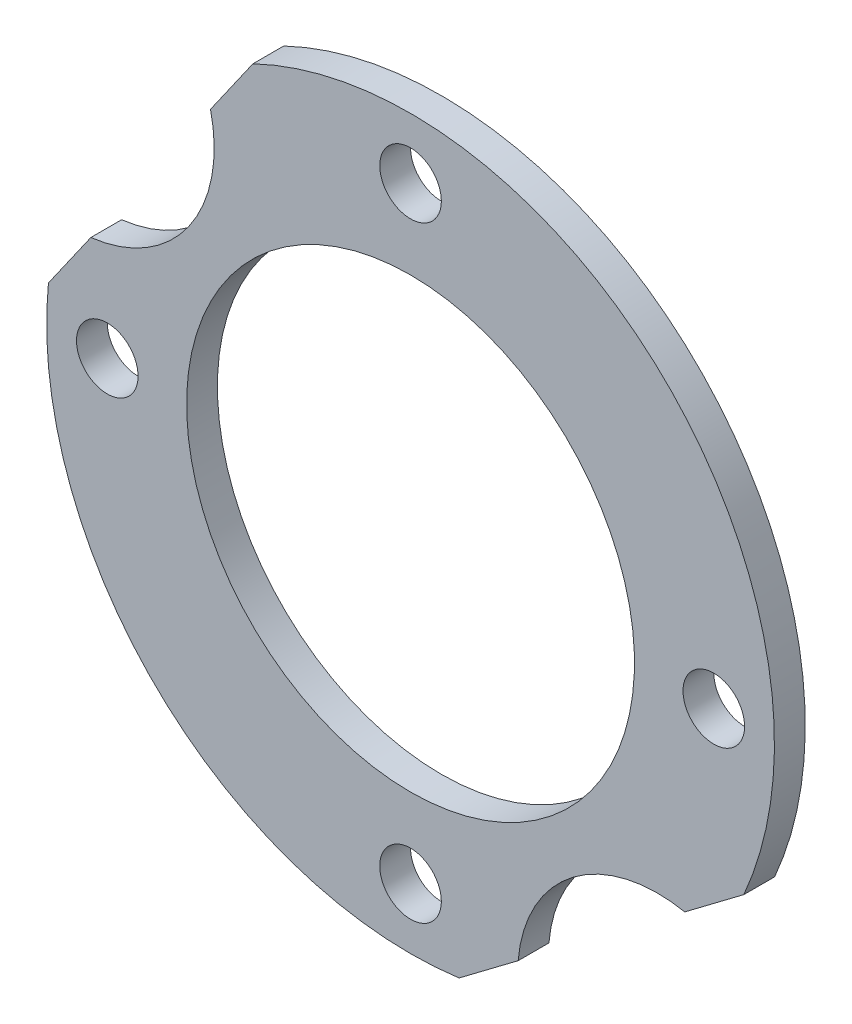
ISO-10303-21;
HEADER;
FILE_DESCRIPTION(('STEP AP214'),'2;1');
FILE_NAME('part.step','',(''),(''),'','','');
FILE_SCHEMA(('AUTOMOTIVE_DESIGN { 1 0 10303 214 1 1 1 1 }'));
ENDSEC;
DATA;
#1=APPLICATION_CONTEXT('core data for automotive mechanical design processes');
#2=APPLICATION_PROTOCOL_DEFINITION('international standard','automotive_design',2000,#1);
#3=PRODUCT_CONTEXT('',#1,'mechanical');
#4=PRODUCT('Part','Part','',(#3));
#5=PRODUCT_RELATED_PRODUCT_CATEGORY('part','',(#4));
#6=PRODUCT_DEFINITION_FORMATION('','',#4);
#7=PRODUCT_DEFINITION_CONTEXT('part definition',#1,'design');
#8=PRODUCT_DEFINITION('design','',#6,#7);
#9=PRODUCT_DEFINITION_SHAPE('','',#8);
#10=(LENGTH_UNIT() NAMED_UNIT(*) SI_UNIT(.MILLI.,.METRE.));
#11=(NAMED_UNIT(*) PLANE_ANGLE_UNIT() SI_UNIT($,.RADIAN.));
#12=(NAMED_UNIT(*) SI_UNIT($,.STERADIAN.) SOLID_ANGLE_UNIT());
#13=UNCERTAINTY_MEASURE_WITH_UNIT(LENGTH_MEASURE(1.E-05),#10,'distance_accuracy_value','');
#14=(GEOMETRIC_REPRESENTATION_CONTEXT(3) GLOBAL_UNCERTAINTY_ASSIGNED_CONTEXT((#13)) GLOBAL_UNIT_ASSIGNED_CONTEXT((#10,
#11,#12)) REPRESENTATION_CONTEXT('',''));
#15=CARTESIAN_POINT('',(0.,0.,0.));
#16=DIRECTION('',(0.,0.,1.));
#17=DIRECTION('',(1.,0.,0.));
#18=AXIS2_PLACEMENT_3D('',#15,#16,#17);
#19=CARTESIAN_POINT('',(344.982648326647,748.800407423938,41.5464573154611));
#20=DIRECTION('',(0.,0.,-1.));
#21=DIRECTION('',(0.,1.,0.));
#22=AXIS2_PLACEMENT_3D('',#19,#20,#21);
#23=PLANE('',#22);
#24=DIRECTION('',(-0.573532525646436,-0.819182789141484,0.));
#25=VECTOR('',#24,1.);
#26=CARTESIAN_POINT('',(331.07798205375,787.046702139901,41.5464573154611));
#27=LINE('',#26,#25);
#28=CARTESIAN_POINT('',(326.532691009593,780.554613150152,41.5464573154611));
#29=VERTEX_POINT('',#28);
#30=CARTESIAN_POINT('',(331.07798205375,787.046702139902,41.5464573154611));
#31=VERTEX_POINT('',#30);
#32=EDGE_CURVE('E78',#29,#31,#27,.F.);
#33=ORIENTED_EDGE('',*,*,#32,.F.);
#34=CARTESIAN_POINT('',(311.928409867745,777.131898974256,41.5464573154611));
#35=DIRECTION('',(0.,0.,-1.));
#36=DIRECTION('',(-1.,0.,0.));
#37=AXIS2_PLACEMENT_3D('',#34,#35,#36);
#38=CIRCLE('',#37,15.);
#39=CARTESIAN_POINT('',(313.7070689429,762.237726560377,41.5464573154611));
#40=VERTEX_POINT('',#39);
#41=EDGE_CURVE('E146',#40,#29,#38,.F.);
#42=ORIENTED_EDGE('',*,*,#41,.F.);
#43=DIRECTION('',(-0.573620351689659,-0.819121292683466,0.));
#44=VECTOR('',#43,1.);
#45=CARTESIAN_POINT('',(313.7070689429,762.237726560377,41.5464573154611));
#46=LINE('',#45,#44);
#47=CARTESIAN_POINT('',(309.161732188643,755.747053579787,41.5464573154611));
#48=VERTEX_POINT('',#47);
#49=EDGE_CURVE('E113',#48,#40,#46,.F.);
#50=ORIENTED_EDGE('',*,*,#49,.F.);
#51=CARTESIAN_POINT('',(347.971056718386,751.895257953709,41.5464573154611));
#52=DIRECTION('',(0.,0.,-1.));
#53=DIRECTION('',(0.,1.,0.));
#54=AXIS2_PLACEMENT_3D('',#51,#52,#53);
#55=CIRCLE('',#54,39.);
#56=CARTESIAN_POINT('',(353.174931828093,713.244000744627,41.5464573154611));
#57=VERTEX_POINT('',#56);
#58=EDGE_CURVE('E149',#57,#48,#55,.T.);
#59=ORIENTED_EDGE('',*,*,#58,.F.);
#60=DIRECTION('',(0.798656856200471,0.601786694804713,0.));
#61=VECTOR('',#60,1.);
#62=CARTESIAN_POINT('',(353.174931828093,713.244000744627,41.5464573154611));
#63=LINE('',#62,#61);
#64=CARTESIAN_POINT('',(359.50361786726,718.012655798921,41.5464573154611));
#65=VERTEX_POINT('',#64);
#66=EDGE_CURVE('E116',#65,#57,#63,.F.);
#67=ORIENTED_EDGE('',*,*,#66,.F.);
#68=CARTESIAN_POINT('',(374.45079146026,716.754879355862,41.5464573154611));
#69=DIRECTION('',(0.,0.,-1.));
#70=DIRECTION('',(-1.,0.,0.));
#71=AXIS2_PLACEMENT_3D('',#68,#69,#70);
#72=CIRCLE('',#71,15.);
#73=CARTESIAN_POINT('',(377.361738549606,731.469714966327,41.5464573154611));
#74=VERTEX_POINT('',#73);
#75=EDGE_CURVE('E97',#74,#65,#72,.F.);
#76=ORIENTED_EDGE('',*,*,#75,.F.);
#77=DIRECTION('',(0.798614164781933,0.601843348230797,0.));
#78=VECTOR('',#77,1.);
#79=CARTESIAN_POINT('',(377.361738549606,731.469714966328,41.5464573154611));
#80=LINE('',#79,#78);
#81=CARTESIAN_POINT('',(383.690647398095,736.239241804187,41.5464573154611));
#82=VERTEX_POINT('',#81);
#83=EDGE_CURVE('E94',#82,#74,#80,.F.);
#84=ORIENTED_EDGE('',*,*,#83,.F.);
#85=CARTESIAN_POINT('',(347.971056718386,751.895257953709,41.5464573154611));
#86=DIRECTION('',(0.,0.,-1.));
#87=DIRECTION('',(0.,1.,0.));
#88=AXIS2_PLACEMENT_3D('',#85,#86,#87);
#89=CIRCLE('',#88,39.);
#90=EDGE_CURVE('E83',#31,#82,#89,.T.);
#91=ORIENTED_EDGE('',*,*,#90,.F.);
#92=EDGE_LOOP('',(#33,#42,#50,#59,#67,#76,#84,#91));
#93=FACE_BOUND('',#92,.T.);
#94=CARTESIAN_POINT('',(380.471098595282,751.895257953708,41.5464573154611));
#95=DIRECTION('',(0.,0.,-1.));
#96=DIRECTION('',(0.,1.,0.));
#97=AXIS2_PLACEMENT_3D('',#94,#95,#96);
#98=CIRCLE('',#97,3.3);
#99=CARTESIAN_POINT('',(380.471098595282,755.195257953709,41.5464573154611));
#100=VERTEX_POINT('',#99);
#101=EDGE_CURVE('E112',#100,#100,#98,.T.);
#102=ORIENTED_EDGE('',*,*,#101,.T.);
#103=EDGE_LOOP('',(#102));
#104=FACE_BOUND('',#103,.T.);
#105=CARTESIAN_POINT('',(347.971056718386,784.395299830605,41.5464573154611));
#106=DIRECTION('',(0.,0.,-1.));
#107=DIRECTION('',(0.,1.,0.));
#108=AXIS2_PLACEMENT_3D('',#105,#106,#107);
#109=CIRCLE('',#108,3.3);
#110=CARTESIAN_POINT('',(347.971056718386,787.695299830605,41.5464573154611));
#111=VERTEX_POINT('',#110);
#112=EDGE_CURVE('E154',#111,#111,#109,.T.);
#113=ORIENTED_EDGE('',*,*,#112,.T.);
#114=EDGE_LOOP('',(#113));
#115=FACE_BOUND('',#114,.T.);
#116=CARTESIAN_POINT('',(315.47101484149,751.895257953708,41.5464573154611));
#117=DIRECTION('',(0.,0.,-1.));
#118=DIRECTION('',(0.,1.,0.));
#119=AXIS2_PLACEMENT_3D('',#116,#117,#118);
#120=CIRCLE('',#119,3.3);
#121=CARTESIAN_POINT('',(315.47101484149,755.195257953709,41.5464573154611));
#122=VERTEX_POINT('',#121);
#123=EDGE_CURVE('E157',#122,#122,#120,.T.);
#124=ORIENTED_EDGE('',*,*,#123,.T.);
#125=EDGE_LOOP('',(#124));
#126=FACE_BOUND('',#125,.T.);
#127=CARTESIAN_POINT('',(347.971056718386,751.895257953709,41.5464573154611));
#128=DIRECTION('',(0.,0.,-1.));
#129=DIRECTION('',(0.,1.,0.));
#130=AXIS2_PLACEMENT_3D('',#127,#128,#129);
#131=CIRCLE('',#130,24.);
#132=CARTESIAN_POINT('',(347.971056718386,775.895257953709,41.5464573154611));
#133=VERTEX_POINT('',#132);
#134=EDGE_CURVE('E159',#133,#133,#131,.T.);
#135=ORIENTED_EDGE('',*,*,#134,.T.);
#136=EDGE_LOOP('',(#135));
#137=FACE_BOUND('',#136,.T.);
#138=CARTESIAN_POINT('',(347.971056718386,719.395216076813,41.5464573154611));
#139=DIRECTION('',(0.,0.,-1.));
#140=DIRECTION('',(0.,1.,0.));
#141=AXIS2_PLACEMENT_3D('',#138,#139,#140);
#142=CIRCLE('',#141,3.3);
#143=CARTESIAN_POINT('',(347.971056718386,722.695216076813,41.5464573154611));
#144=VERTEX_POINT('',#143);
#145=EDGE_CURVE('E20',#144,#144,#142,.T.);
#146=ORIENTED_EDGE('',*,*,#145,.T.);
#147=EDGE_LOOP('',(#146));
#148=FACE_BOUND('',#147,.T.);
#149=ADVANCED_FACE('F16',(#93,#104,#115,#126,#137,#148),#23,.F.);
#150=CARTESIAN_POINT('',(347.971056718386,719.395216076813,41.5464573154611));
#151=DIRECTION('',(0.,0.,-1.));
#152=DIRECTION('',(0.,1.,0.));
#153=AXIS2_PLACEMENT_3D('',#150,#151,#152);
#154=CYLINDRICAL_SURFACE('',#153,3.3);
#155=CARTESIAN_POINT('',(347.971056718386,719.395216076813,38.2464573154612));
#156=DIRECTION('',(0.,0.,-1.));
#157=DIRECTION('',(0.,1.,0.));
#158=AXIS2_PLACEMENT_3D('',#155,#156,#157);
#159=CIRCLE('',#158,3.3);
#160=CARTESIAN_POINT('',(347.971056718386,722.695216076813,38.2464573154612));
#161=VERTEX_POINT('',#160);
#162=EDGE_CURVE('E142',#161,#161,#159,.F.);
#163=ORIENTED_EDGE('',*,*,#162,.F.);
#164=EDGE_LOOP('',(#163));
#165=FACE_BOUND('',#164,.T.);
#166=ORIENTED_EDGE('',*,*,#145,.F.);
#167=EDGE_LOOP('',(#166));
#168=FACE_BOUND('',#167,.T.);
#169=ADVANCED_FACE('F172',(#165,#168),#154,.F.);
#170=CARTESIAN_POINT('',(347.971056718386,751.895257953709,41.5464573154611));
#171=DIRECTION('',(0.,0.,-1.));
#172=DIRECTION('',(0.,1.,0.));
#173=AXIS2_PLACEMENT_3D('',#170,#171,#172);
#174=CYLINDRICAL_SURFACE('',#173,24.);
#175=CARTESIAN_POINT('',(347.971056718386,751.895257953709,38.2464573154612));
#176=DIRECTION('',(0.,0.,-1.));
#177=DIRECTION('',(0.,1.,0.));
#178=AXIS2_PLACEMENT_3D('',#175,#176,#177);
#179=CIRCLE('',#178,24.);
#180=CARTESIAN_POINT('',(347.971056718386,775.895257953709,38.2464573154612));
#181=VERTEX_POINT('',#180);
#182=EDGE_CURVE('E139',#181,#181,#179,.F.);
#183=ORIENTED_EDGE('',*,*,#182,.F.);
#184=EDGE_LOOP('',(#183));
#185=FACE_BOUND('',#184,.T.);
#186=ORIENTED_EDGE('',*,*,#134,.F.);
#187=EDGE_LOOP('',(#186));
#188=FACE_BOUND('',#187,.T.);
#189=ADVANCED_FACE('F174',(#185,#188),#174,.F.);
#190=CARTESIAN_POINT('',(315.47101484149,751.895257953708,41.5464573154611));
#191=DIRECTION('',(0.,0.,-1.));
#192=DIRECTION('',(0.,1.,0.));
#193=AXIS2_PLACEMENT_3D('',#190,#191,#192);
#194=CYLINDRICAL_SURFACE('',#193,3.3);
#195=CARTESIAN_POINT('',(315.47101484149,751.895257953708,38.2464573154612));
#196=DIRECTION('',(0.,0.,-1.));
#197=DIRECTION('',(0.,1.,0.));
#198=AXIS2_PLACEMENT_3D('',#195,#196,#197);
#199=CIRCLE('',#198,3.3);
#200=CARTESIAN_POINT('',(315.47101484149,755.195257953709,38.2464573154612));
#201=VERTEX_POINT('',#200);
#202=EDGE_CURVE('E136',#201,#201,#199,.F.);
#203=ORIENTED_EDGE('',*,*,#202,.F.);
#204=EDGE_LOOP('',(#203));
#205=FACE_BOUND('',#204,.T.);
#206=ORIENTED_EDGE('',*,*,#123,.F.);
#207=EDGE_LOOP('',(#206));
#208=FACE_BOUND('',#207,.T.);
#209=ADVANCED_FACE('F181',(#205,#208),#194,.F.);
#210=CARTESIAN_POINT('',(347.971056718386,784.395299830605,41.5464573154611));
#211=DIRECTION('',(0.,0.,-1.));
#212=DIRECTION('',(0.,1.,0.));
#213=AXIS2_PLACEMENT_3D('',#210,#211,#212);
#214=CYLINDRICAL_SURFACE('',#213,3.3);
#215=CARTESIAN_POINT('',(347.971056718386,784.395299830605,38.2464573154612));
#216=DIRECTION('',(0.,0.,-1.));
#217=DIRECTION('',(0.,1.,0.));
#218=AXIS2_PLACEMENT_3D('',#215,#216,#217);
#219=CIRCLE('',#218,3.3);
#220=CARTESIAN_POINT('',(347.971056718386,787.695299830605,38.2464573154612));
#221=VERTEX_POINT('',#220);
#222=EDGE_CURVE('E133',#221,#221,#219,.F.);
#223=ORIENTED_EDGE('',*,*,#222,.F.);
#224=EDGE_LOOP('',(#223));
#225=FACE_BOUND('',#224,.T.);
#226=ORIENTED_EDGE('',*,*,#112,.F.);
#227=EDGE_LOOP('',(#226));
#228=FACE_BOUND('',#227,.T.);
#229=ADVANCED_FACE('F208',(#225,#228),#214,.F.);
#230=CARTESIAN_POINT('',(380.471098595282,751.895257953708,41.5464573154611));
#231=DIRECTION('',(0.,0.,-1.));
#232=DIRECTION('',(0.,1.,0.));
#233=AXIS2_PLACEMENT_3D('',#230,#231,#232);
#234=CYLINDRICAL_SURFACE('',#233,3.3);
#235=CARTESIAN_POINT('',(380.471098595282,751.895257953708,38.2464573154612));
#236=DIRECTION('',(0.,0.,-1.));
#237=DIRECTION('',(0.,1.,0.));
#238=AXIS2_PLACEMENT_3D('',#235,#236,#237);
#239=CIRCLE('',#238,3.3);
#240=CARTESIAN_POINT('',(380.471098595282,755.195257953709,38.2464573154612));
#241=VERTEX_POINT('',#240);
#242=EDGE_CURVE('E130',#241,#241,#239,.F.);
#243=ORIENTED_EDGE('',*,*,#242,.F.);
#244=EDGE_LOOP('',(#243));
#245=FACE_BOUND('',#244,.T.);
#246=ORIENTED_EDGE('',*,*,#101,.F.);
#247=EDGE_LOOP('',(#246));
#248=FACE_BOUND('',#247,.T.);
#249=ADVANCED_FACE('F215',(#245,#248),#234,.F.);
#250=CARTESIAN_POINT('',(331.07798205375,787.046702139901,41.5464573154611));
#251=DIRECTION('',(-0.819182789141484,0.573532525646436,0.));
#252=DIRECTION('',(-0.573532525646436,-0.819182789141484,0.));
#253=AXIS2_PLACEMENT_3D('',#250,#251,#252);
#254=PLANE('',#253);
#255=ORIENTED_EDGE('',*,*,#32,.T.);
#256=DIRECTION('',(0.,0.,-1.));
#257=VECTOR('',#256,1.);
#258=CARTESIAN_POINT('',(331.07798205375,787.046702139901,41.5464573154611));
#259=LINE('',#258,#257);
#260=CARTESIAN_POINT('',(331.07798205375,787.046702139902,38.2464573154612));
#261=VERTEX_POINT('',#260);
#262=EDGE_CURVE('E90',#261,#31,#259,.F.);
#263=ORIENTED_EDGE('',*,*,#262,.F.);
#264=DIRECTION('',(0.573532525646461,0.819182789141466,0.));
#265=VECTOR('',#264,1.);
#266=CARTESIAN_POINT('',(326.532691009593,780.554613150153,38.2464573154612));
#267=LINE('',#266,#265);
#268=CARTESIAN_POINT('',(326.532691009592,780.554613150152,38.2464573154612));
#269=VERTEX_POINT('',#268);
#270=EDGE_CURVE('E129',#269,#261,#267,.T.);
#271=ORIENTED_EDGE('',*,*,#270,.F.);
#272=DIRECTION('',(0.,0.,-1.));
#273=VECTOR('',#272,1.);
#274=CARTESIAN_POINT('',(326.532691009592,780.554613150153,41.5464573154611));
#275=LINE('',#274,#273);
#276=EDGE_CURVE('E145',#29,#269,#275,.T.);
#277=ORIENTED_EDGE('',*,*,#276,.F.);
#278=EDGE_LOOP('',(#255,#263,#271,#277));
#279=FACE_BOUND('',#278,.T.);
#280=ADVANCED_FACE('F220',(#279),#254,.T.);
#281=CARTESIAN_POINT('',(347.971056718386,751.895257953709,41.5464573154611));
#282=DIRECTION('',(0.,0.,-1.));
#283=DIRECTION('',(0.,1.,0.));
#284=AXIS2_PLACEMENT_3D('',#281,#282,#283);
#285=CYLINDRICAL_SURFACE('',#284,39.);
#286=ORIENTED_EDGE('',*,*,#90,.T.);
#287=DIRECTION('',(0.,0.,1.));
#288=VECTOR('',#287,1.);
#289=CARTESIAN_POINT('',(383.690647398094,736.239241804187,41.5464573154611));
#290=LINE('',#289,#288);
#291=CARTESIAN_POINT('',(383.690647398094,736.239241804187,38.2464573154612));
#292=VERTEX_POINT('',#291);
#293=EDGE_CURVE('E88',#292,#82,#290,.T.);
#294=ORIENTED_EDGE('',*,*,#293,.F.);
#295=CARTESIAN_POINT('',(347.971056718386,751.895257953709,38.2464573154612));
#296=DIRECTION('',(0.,0.,-1.));
#297=DIRECTION('',(0.,1.,0.));
#298=AXIS2_PLACEMENT_3D('',#295,#296,#297);
#299=CIRCLE('',#298,39.);
#300=EDGE_CURVE('E127',#261,#292,#299,.T.);
#301=ORIENTED_EDGE('',*,*,#300,.F.);
#302=ORIENTED_EDGE('',*,*,#262,.T.);
#303=EDGE_LOOP('',(#286,#294,#301,#302));
#304=FACE_BOUND('',#303,.T.);
#305=ADVANCED_FACE('F85',(#304),#285,.T.);
#306=CARTESIAN_POINT('',(377.361738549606,731.469714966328,41.5464573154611));
#307=DIRECTION('',(0.601843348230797,-0.798614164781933,0.));
#308=DIRECTION('',(0.798614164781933,0.601843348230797,0.));
#309=AXIS2_PLACEMENT_3D('',#306,#307,#308);
#310=PLANE('',#309);
#311=ORIENTED_EDGE('',*,*,#83,.T.);
#312=DIRECTION('',(0.,0.,-1.));
#313=VECTOR('',#312,1.);
#314=CARTESIAN_POINT('',(377.361738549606,731.469714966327,41.5464573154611));
#315=LINE('',#314,#313);
#316=CARTESIAN_POINT('',(377.361738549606,731.469714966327,38.2464573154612));
#317=VERTEX_POINT('',#316);
#318=EDGE_CURVE('E100',#317,#74,#315,.F.);
#319=ORIENTED_EDGE('',*,*,#318,.F.);
#320=DIRECTION('',(-0.798614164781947,-0.601843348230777,0.));
#321=VECTOR('',#320,1.);
#322=CARTESIAN_POINT('',(383.690647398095,736.239241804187,38.2464573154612));
#323=LINE('',#322,#321);
#324=EDGE_CURVE('E104',#292,#317,#323,.T.);
#325=ORIENTED_EDGE('',*,*,#324,.F.);
#326=ORIENTED_EDGE('',*,*,#293,.T.);
#327=EDGE_LOOP('',(#311,#319,#325,#326));
#328=FACE_BOUND('',#327,.T.);
#329=ADVANCED_FACE('F102',(#328),#310,.T.);
#330=CARTESIAN_POINT('',(374.45079146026,716.754879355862,41.5464573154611));
#331=DIRECTION('',(0.,0.,-1.));
#332=DIRECTION('',(-1.,0.,0.));
#333=AXIS2_PLACEMENT_3D('',#330,#331,#332);
#334=CYLINDRICAL_SURFACE('',#333,15.);
#335=ORIENTED_EDGE('',*,*,#75,.T.);
#336=DIRECTION('',(0.,0.,1.));
#337=VECTOR('',#336,1.);
#338=CARTESIAN_POINT('',(359.50361786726,718.012655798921,41.5464573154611));
#339=LINE('',#338,#337);
#340=CARTESIAN_POINT('',(359.50361786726,718.012655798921,38.2464573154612));
#341=VERTEX_POINT('',#340);
#342=EDGE_CURVE('E118',#341,#65,#339,.T.);
#343=ORIENTED_EDGE('',*,*,#342,.F.);
#344=CARTESIAN_POINT('',(374.45079146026,716.754879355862,38.2464573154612));
#345=DIRECTION('',(0.,0.,-1.));
#346=DIRECTION('',(-1.,0.,0.));
#347=AXIS2_PLACEMENT_3D('',#344,#345,#346);
#348=CIRCLE('',#347,15.);
#349=EDGE_CURVE('E124',#317,#341,#348,.F.);
#350=ORIENTED_EDGE('',*,*,#349,.F.);
#351=ORIENTED_EDGE('',*,*,#318,.T.);
#352=EDGE_LOOP('',(#335,#343,#350,#351));
#353=FACE_BOUND('',#352,.T.);
#354=ADVANCED_FACE('F228',(#353),#334,.F.);
#355=CARTESIAN_POINT('',(353.174931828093,713.244000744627,41.5464573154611));
#356=DIRECTION('',(0.601786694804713,-0.798656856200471,0.));
#357=DIRECTION('',(0.798656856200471,0.601786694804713,0.));
#358=AXIS2_PLACEMENT_3D('',#355,#356,#357);
#359=PLANE('',#358);
#360=ORIENTED_EDGE('',*,*,#66,.T.);
#361=DIRECTION('',(0.,0.,-1.));
#362=VECTOR('',#361,1.);
#363=CARTESIAN_POINT('',(353.174931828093,713.244000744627,41.5464573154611));
#364=LINE('',#363,#362);
#365=CARTESIAN_POINT('',(353.174931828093,713.244000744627,38.2464573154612));
#366=VERTEX_POINT('',#365);
#367=EDGE_CURVE('E117',#366,#57,#364,.F.);
#368=ORIENTED_EDGE('',*,*,#367,.F.);
#369=DIRECTION('',(-0.798656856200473,-0.60178669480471,0.));
#370=VECTOR('',#369,1.);
#371=CARTESIAN_POINT('',(359.50361786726,718.012655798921,38.2464573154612));
#372=LINE('',#371,#370);
#373=EDGE_CURVE('E123',#341,#366,#372,.T.);
#374=ORIENTED_EDGE('',*,*,#373,.F.);
#375=ORIENTED_EDGE('',*,*,#342,.T.);
#376=EDGE_LOOP('',(#360,#368,#374,#375));
#377=FACE_BOUND('',#376,.T.);
#378=ADVANCED_FACE('F231',(#377),#359,.T.);
#379=CARTESIAN_POINT('',(347.971056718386,751.895257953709,41.5464573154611));
#380=DIRECTION('',(0.,0.,-1.));
#381=DIRECTION('',(0.,1.,0.));
#382=AXIS2_PLACEMENT_3D('',#379,#380,#381);
#383=CYLINDRICAL_SURFACE('',#382,39.);
#384=ORIENTED_EDGE('',*,*,#58,.T.);
#385=DIRECTION('',(0.,0.,1.));
#386=VECTOR('',#385,1.);
#387=CARTESIAN_POINT('',(309.161732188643,755.747053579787,41.5464573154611));
#388=LINE('',#387,#386);
#389=CARTESIAN_POINT('',(309.161732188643,755.747053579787,38.2464573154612));
#390=VERTEX_POINT('',#389);
#391=EDGE_CURVE('E115',#390,#48,#388,.T.);
#392=ORIENTED_EDGE('',*,*,#391,.F.);
#393=CARTESIAN_POINT('',(347.971056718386,751.895257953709,38.2464573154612));
#394=DIRECTION('',(0.,0.,-1.));
#395=DIRECTION('',(0.,1.,0.));
#396=AXIS2_PLACEMENT_3D('',#393,#394,#395);
#397=CIRCLE('',#396,39.);
#398=EDGE_CURVE('E120',#366,#390,#397,.T.);
#399=ORIENTED_EDGE('',*,*,#398,.F.);
#400=ORIENTED_EDGE('',*,*,#367,.T.);
#401=EDGE_LOOP('',(#384,#392,#399,#400));
#402=FACE_BOUND('',#401,.T.);
#403=ADVANCED_FACE('F235',(#402),#383,.T.);
#404=CARTESIAN_POINT('',(313.7070689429,762.237726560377,41.5464573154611));
#405=DIRECTION('',(-0.819121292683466,0.573620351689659,0.));
#406=DIRECTION('',(-0.573620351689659,-0.819121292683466,0.));
#407=AXIS2_PLACEMENT_3D('',#404,#405,#406);
#408=PLANE('',#407);
#409=ORIENTED_EDGE('',*,*,#49,.T.);
#410=DIRECTION('',(0.,0.,-1.));
#411=VECTOR('',#410,1.);
#412=CARTESIAN_POINT('',(313.7070689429,762.237726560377,41.5464573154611));
#413=LINE('',#412,#411);
#414=CARTESIAN_POINT('',(313.7070689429,762.237726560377,38.2464573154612));
#415=VERTEX_POINT('',#414);
#416=EDGE_CURVE('E35',#415,#40,#413,.F.);
#417=ORIENTED_EDGE('',*,*,#416,.F.);
#418=DIRECTION('',(0.573620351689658,0.819121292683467,0.));
#419=VECTOR('',#418,1.);
#420=CARTESIAN_POINT('',(309.161732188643,755.747053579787,38.2464573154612));
#421=LINE('',#420,#419);
#422=EDGE_CURVE('E26',#390,#415,#421,.T.);
#423=ORIENTED_EDGE('',*,*,#422,.F.);
#424=ORIENTED_EDGE('',*,*,#391,.T.);
#425=EDGE_LOOP('',(#409,#417,#423,#424));
#426=FACE_BOUND('',#425,.T.);
#427=ADVANCED_FACE('F193',(#426),#408,.T.);
#428=CARTESIAN_POINT('',(311.928409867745,777.131898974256,41.5464573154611));
#429=DIRECTION('',(0.,0.,-1.));
#430=DIRECTION('',(-1.,0.,0.));
#431=AXIS2_PLACEMENT_3D('',#428,#429,#430);
#432=CYLINDRICAL_SURFACE('',#431,15.);
#433=ORIENTED_EDGE('',*,*,#41,.T.);
#434=ORIENTED_EDGE('',*,*,#276,.T.);
#435=CARTESIAN_POINT('',(311.928409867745,777.131898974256,38.2464573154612));
#436=DIRECTION('',(0.,0.,-1.));
#437=DIRECTION('',(-1.,0.,0.));
#438=AXIS2_PLACEMENT_3D('',#435,#436,#437);
#439=CIRCLE('',#438,15.);
#440=EDGE_CURVE('E11',#415,#269,#439,.F.);
#441=ORIENTED_EDGE('',*,*,#440,.F.);
#442=ORIENTED_EDGE('',*,*,#416,.T.);
#443=EDGE_LOOP('',(#433,#434,#441,#442));
#444=FACE_BOUND('',#443,.T.);
#445=ADVANCED_FACE('F188',(#444),#432,.F.);
#446=CARTESIAN_POINT('',(331.07798205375,787.046702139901,38.2464573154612));
#447=DIRECTION('',(0.,0.,-1.));
#448=DIRECTION('',(0.,1.,0.));
#449=AXIS2_PLACEMENT_3D('',#446,#447,#448);
#450=PLANE('',#449);
#451=ORIENTED_EDGE('',*,*,#422,.T.);
#452=ORIENTED_EDGE('',*,*,#440,.T.);
#453=ORIENTED_EDGE('',*,*,#270,.T.);
#454=ORIENTED_EDGE('',*,*,#300,.T.);
#455=ORIENTED_EDGE('',*,*,#324,.T.);
#456=ORIENTED_EDGE('',*,*,#349,.T.);
#457=ORIENTED_EDGE('',*,*,#373,.T.);
#458=ORIENTED_EDGE('',*,*,#398,.T.);
#459=EDGE_LOOP('',(#451,#452,#453,#454,#455,#456,#457,#458));
#460=FACE_BOUND('',#459,.T.);
#461=ORIENTED_EDGE('',*,*,#242,.T.);
#462=EDGE_LOOP('',(#461));
#463=FACE_BOUND('',#462,.T.);
#464=ORIENTED_EDGE('',*,*,#222,.T.);
#465=EDGE_LOOP('',(#464));
#466=FACE_BOUND('',#465,.T.);
#467=ORIENTED_EDGE('',*,*,#202,.T.);
#468=EDGE_LOOP('',(#467));
#469=FACE_BOUND('',#468,.T.);
#470=ORIENTED_EDGE('',*,*,#182,.T.);
#471=EDGE_LOOP('',(#470));
#472=FACE_BOUND('',#471,.T.);
#473=ORIENTED_EDGE('',*,*,#162,.T.);
#474=EDGE_LOOP('',(#473));
#475=FACE_BOUND('',#474,.T.);
#476=ADVANCED_FACE('F18',(#460,#463,#466,#469,#472,#475),#450,.T.);
#477=CLOSED_SHELL('',(#149,#169,#189,#209,#229,#249,#280,#305,#329,#354,#378,#403,#427,#445,#476));
#478=MANIFOLD_SOLID_BREP('B1',#477);
#479=ADVANCED_BREP_SHAPE_REPRESENTATION('',(#18,#478),#14);
#480=SHAPE_DEFINITION_REPRESENTATION(#9,#479);
ENDSEC;
END-ISO-10303-21;
